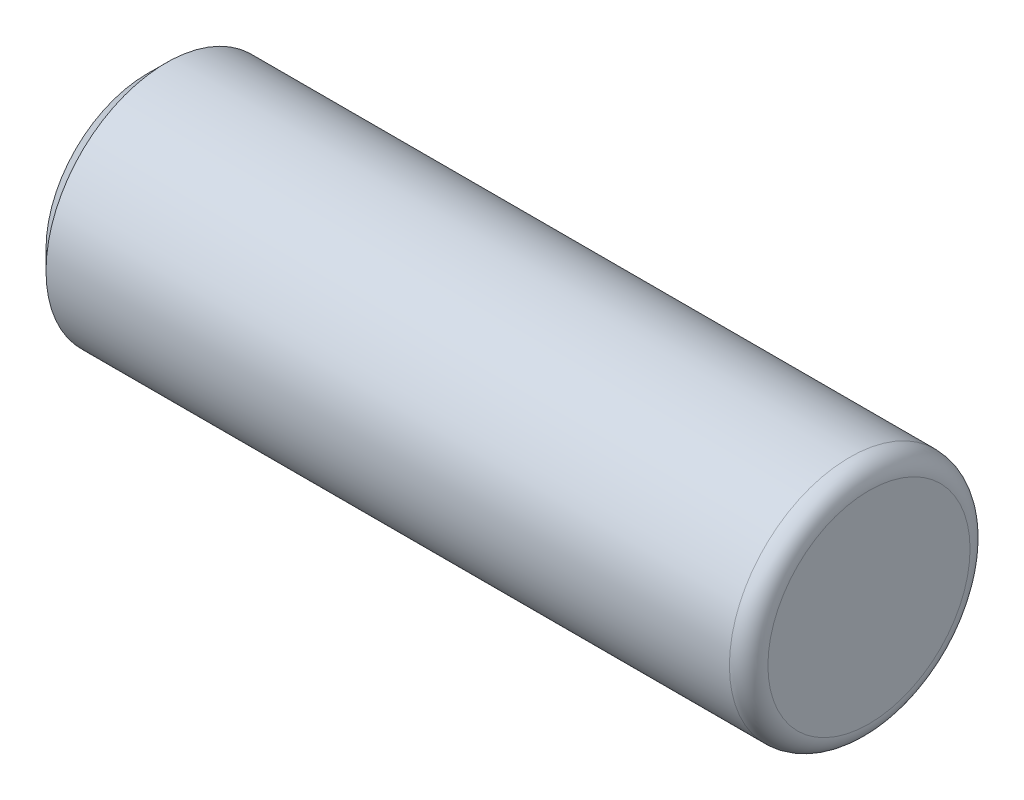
ISO-10303-21;
HEADER;
FILE_DESCRIPTION(('STEP AP214'),'2;1');
FILE_NAME('part.step','',(''),(''),'','','');
FILE_SCHEMA(('AUTOMOTIVE_DESIGN { 1 0 10303 214 1 1 1 1 }'));
ENDSEC;
DATA;
#1=APPLICATION_CONTEXT('core data for automotive mechanical design processes');
#2=APPLICATION_PROTOCOL_DEFINITION('international standard','automotive_design',2000,#1);
#3=PRODUCT_CONTEXT('',#1,'mechanical');
#4=PRODUCT('Part','Part','',(#3));
#5=PRODUCT_RELATED_PRODUCT_CATEGORY('part','',(#4));
#6=PRODUCT_DEFINITION_FORMATION('','',#4);
#7=PRODUCT_DEFINITION_CONTEXT('part definition',#1,'design');
#8=PRODUCT_DEFINITION('design','',#6,#7);
#9=PRODUCT_DEFINITION_SHAPE('','',#8);
#10=(LENGTH_UNIT() NAMED_UNIT(*) SI_UNIT(.MILLI.,.METRE.));
#11=(NAMED_UNIT(*) PLANE_ANGLE_UNIT() SI_UNIT($,.RADIAN.));
#12=(NAMED_UNIT(*) SI_UNIT($,.STERADIAN.) SOLID_ANGLE_UNIT());
#13=UNCERTAINTY_MEASURE_WITH_UNIT(LENGTH_MEASURE(1.E-05),#10,'distance_accuracy_value','');
#14=(GEOMETRIC_REPRESENTATION_CONTEXT(3) GLOBAL_UNCERTAINTY_ASSIGNED_CONTEXT((#13)) GLOBAL_UNIT_ASSIGNED_CONTEXT((#10,
#11,#12)) REPRESENTATION_CONTEXT('',''));
#15=CARTESIAN_POINT('',(0.,0.,0.));
#16=DIRECTION('',(0.,0.,1.));
#17=DIRECTION('',(1.,0.,0.));
#18=AXIS2_PLACEMENT_3D('',#15,#16,#17);
#19=CARTESIAN_POINT('',(-19.05,0.,0.));
#20=DIRECTION('',(1.,0.,0.));
#21=DIRECTION('',(0.,0.,-1.));
#22=AXIS2_PLACEMENT_3D('',#19,#20,#21);
#23=PLANE('',#22);
#24=CARTESIAN_POINT('',(-19.05,0.,0.));
#25=DIRECTION('',(1.,0.,0.));
#26=DIRECTION('',(0.,0.,-1.));
#27=AXIS2_PLACEMENT_3D('',#24,#25,#26);
#28=CIRCLE('',#27,2.667);
#29=CARTESIAN_POINT('',(-19.05,0.,-2.667));
#30=VERTEX_POINT('',#29);
#31=EDGE_CURVE('E45',#30,#30,#28,.F.);
#32=ORIENTED_EDGE('',*,*,#31,.T.);
#33=EDGE_LOOP('',(#32));
#34=FACE_BOUND('',#33,.T.);
#35=ADVANCED_FACE('F30',(#34),#23,.F.);
#36=CARTESIAN_POINT('',(-14.1565331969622,0.,0.));
#37=DIRECTION('',(-1.,0.,0.));
#38=DIRECTION('',(0.,0.,1.));
#39=AXIS2_PLACEMENT_3D('',#36,#37,#38);
#40=CYLINDRICAL_SURFACE('',#39,3.175);
#41=CARTESIAN_POINT('',(-0.508,0.,0.));
#42=DIRECTION('',(-1.,0.,0.));
#43=DIRECTION('',(0.,0.,1.));
#44=AXIS2_PLACEMENT_3D('',#41,#42,#43);
#45=CIRCLE('',#44,3.175);
#46=CARTESIAN_POINT('',(-0.508,0.,3.175));
#47=VERTEX_POINT('',#46);
#48=EDGE_CURVE('E37',#47,#47,#45,.T.);
#49=ORIENTED_EDGE('',*,*,#48,.T.);
#50=EDGE_LOOP('',(#49));
#51=FACE_BOUND('',#50,.T.);
#52=CARTESIAN_POINT('',(-18.542,0.,0.));
#53=DIRECTION('',(1.,0.,0.));
#54=DIRECTION('',(0.,0.,-1.));
#55=AXIS2_PLACEMENT_3D('',#52,#53,#54);
#56=CIRCLE('',#55,3.175);
#57=CARTESIAN_POINT('',(-18.542,0.,-3.175));
#58=VERTEX_POINT('',#57);
#59=EDGE_CURVE('E41',#58,#58,#56,.T.);
#60=ORIENTED_EDGE('',*,*,#59,.T.);
#61=EDGE_LOOP('',(#60));
#62=FACE_BOUND('',#61,.T.);
#63=ADVANCED_FACE('F61',(#51,#62),#40,.T.);
#64=CARTESIAN_POINT('',(0.,3.175,0.));
#65=DIRECTION('',(-1.,0.,0.));
#66=DIRECTION('',(0.,0.,1.));
#67=AXIS2_PLACEMENT_3D('',#64,#65,#66);
#68=PLANE('',#67);
#69=CARTESIAN_POINT('',(0.,0.,0.));
#70=DIRECTION('',(-1.,0.,0.));
#71=DIRECTION('',(0.,0.,1.));
#72=AXIS2_PLACEMENT_3D('',#69,#70,#71);
#73=CIRCLE('',#72,2.667);
#74=CARTESIAN_POINT('',(0.,0.,2.667));
#75=VERTEX_POINT('',#74);
#76=EDGE_CURVE('E10',#75,#75,#73,.F.);
#77=ORIENTED_EDGE('',*,*,#76,.T.);
#78=EDGE_LOOP('',(#77));
#79=FACE_BOUND('',#78,.T.);
#80=ADVANCED_FACE('F54',(#79),#68,.F.);
#81=CARTESIAN_POINT('',(-19.05,0.,0.));
#82=DIRECTION('',(1.,0.,0.));
#83=DIRECTION('',(0.,0.,-1.));
#84=AXIS2_PLACEMENT_3D('',#81,#82,#83);
#85=CONICAL_SURFACE('',#84,2.667,0.785398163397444);
#86=ORIENTED_EDGE('',*,*,#59,.F.);
#87=EDGE_LOOP('',(#86));
#88=FACE_BOUND('',#87,.T.);
#89=ORIENTED_EDGE('',*,*,#31,.F.);
#90=EDGE_LOOP('',(#89));
#91=FACE_BOUND('',#90,.T.);
#92=ADVANCED_FACE('F52',(#88,#91),#85,.T.);
#93=CARTESIAN_POINT('',(-0.508,0.,0.));
#94=DIRECTION('',(-1.,0.,0.));
#95=DIRECTION('',(0.,0.,1.));
#96=AXIS2_PLACEMENT_3D('',#93,#94,#95);
#97=TOROIDAL_SURFACE('',#96,2.667,0.508);
#98=ORIENTED_EDGE('',*,*,#76,.F.);
#99=EDGE_LOOP('',(#98));
#100=FACE_BOUND('',#99,.T.);
#101=ORIENTED_EDGE('',*,*,#48,.F.);
#102=EDGE_LOOP('',(#101));
#103=FACE_BOUND('',#102,.T.);
#104=ADVANCED_FACE('F32',(#100,#103),#97,.T.);
#105=CLOSED_SHELL('',(#35,#63,#80,#92,#104));
#106=MANIFOLD_SOLID_BREP('B2',#105);
#107=ADVANCED_BREP_SHAPE_REPRESENTATION('',(#18,#106),#14);
#108=SHAPE_DEFINITION_REPRESENTATION(#9,#107);
ENDSEC;
END-ISO-10303-21;
